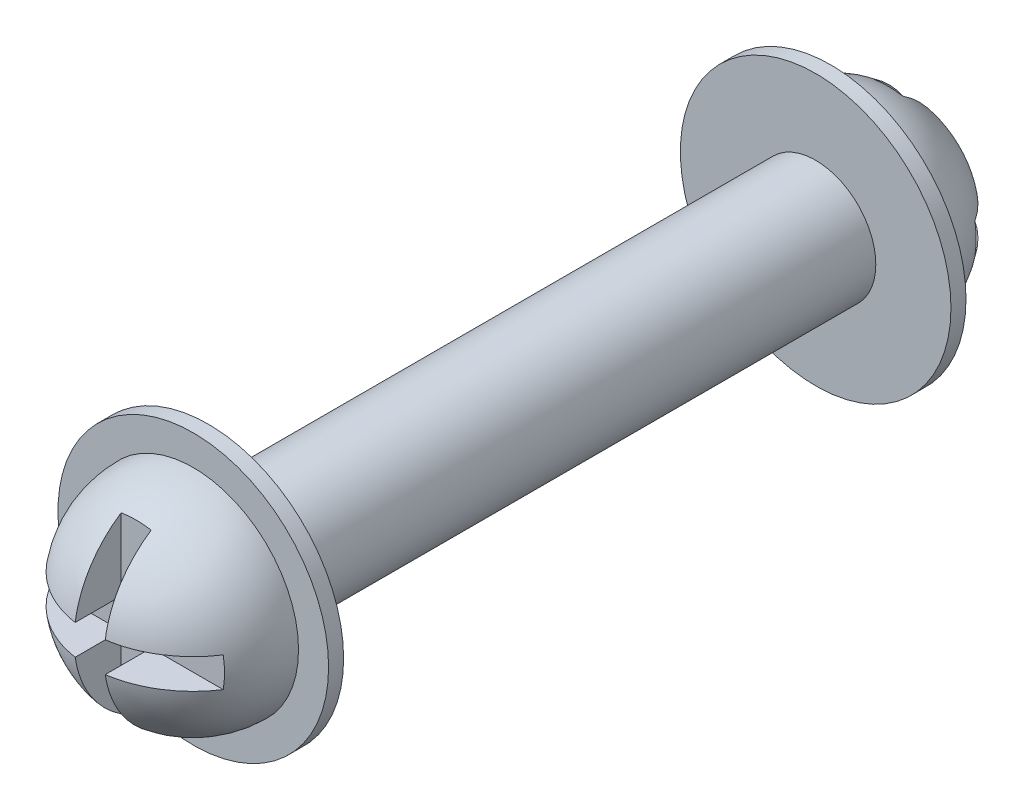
from build123d import *

# Parameters (mm, degrees)
CUT_EXTRUDE1_DEPTH      = 50.116131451
CUT_EXTRUDE1_DEPTH_BACK = 50.116131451
SKETCH2_W               = 6.35
SKETCH2_H               = 3.175
CUT_EXTRUDE2_DEPTH      = 50.04120112
CUT_EXTRUDE2_DEPTH_BACK = 50.04120112
SKETCH3_W               = 7.62
SKETCH3_H               = 3.175


with BuildPart() as part:
    # Sketch1 → Revolve1 (revolve)
    with BuildSketch(Plane(origin=(0, 0, 0), x_dir=(0, 0, -1), z_dir=(1, 0, 0)), mode=Mode.PRIVATE) as revolve1_sk:
        with BuildLine():
            Line((-32.0675, 6.35), (-32.0675, 14.2875))
            Line((-32.0675, 14.2875), (-33.655, 14.2875))
            Line((-33.655, 14.2875), (-33.655, 11.1125))
            ThreePointArc((-33.655, 11.1125), (-41.512724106, 7.857724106), (-44.7675, 0))
            Line((-44.7675, 0), (44.7675, 0))
            ThreePointArc((44.7675, 0), (41.512724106, 7.857724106), (33.655, 11.1125))
            Line((33.655, 11.1125), (33.655, 14.2875))
            Line((33.655, 14.2875), (32.0675, 14.2875))
            Line((32.0675, 14.2875), (32.0675, 6.35))
            Line((32.0675, 6.35), (-32.0675, 6.35))
        make_face()
    revolve(revolve1_sk.sketch.rotate(Axis((0, 0, 77.178613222), (0, 0, -1)), 90), axis=Axis((0, 0, 77.178613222), (0, 0, -1)))

    # Sketch2 → Cut-Extrude1 (cut, two sides: drawn at the far end of the back side and taken through both)
    with BuildSketch(Plane(origin=(0, 0, 0), x_dir=(0, 0, -1), z_dir=(1, 0, 0)).offset(-CUT_EXTRUDE1_DEPTH_BACK)):
        with Locations((-42.8625, 0)):
            Rectangle(SKETCH2_W, SKETCH2_H)
        with Locations((42.8625, 0)):
            Rectangle(SKETCH2_W, SKETCH2_H)
    extrude(amount=CUT_EXTRUDE1_DEPTH + CUT_EXTRUDE1_DEPTH_BACK, mode=Mode.SUBTRACT)

    # Sketch3 → Cut-Extrude2 (cut, two sides: drawn at the far end of the back side and taken through both)
    with BuildSketch(Plane(origin=(0.05268303, 0, -0.014876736), x_dir=(0, 0, -1), z_dir=(0, 1, 0)).offset(-CUT_EXTRUDE2_DEPTH_BACK)):
        with Locations((-43.512376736, 0.05268303)):
            Rectangle(SKETCH3_W, SKETCH3_H)
        with Locations((43.482623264, 0.05268303)):
            Rectangle(SKETCH3_W, SKETCH3_H)
    extrude(amount=CUT_EXTRUDE2_DEPTH + CUT_EXTRUDE2_DEPTH_BACK, mode=Mode.SUBTRACT)


solid = part.part
